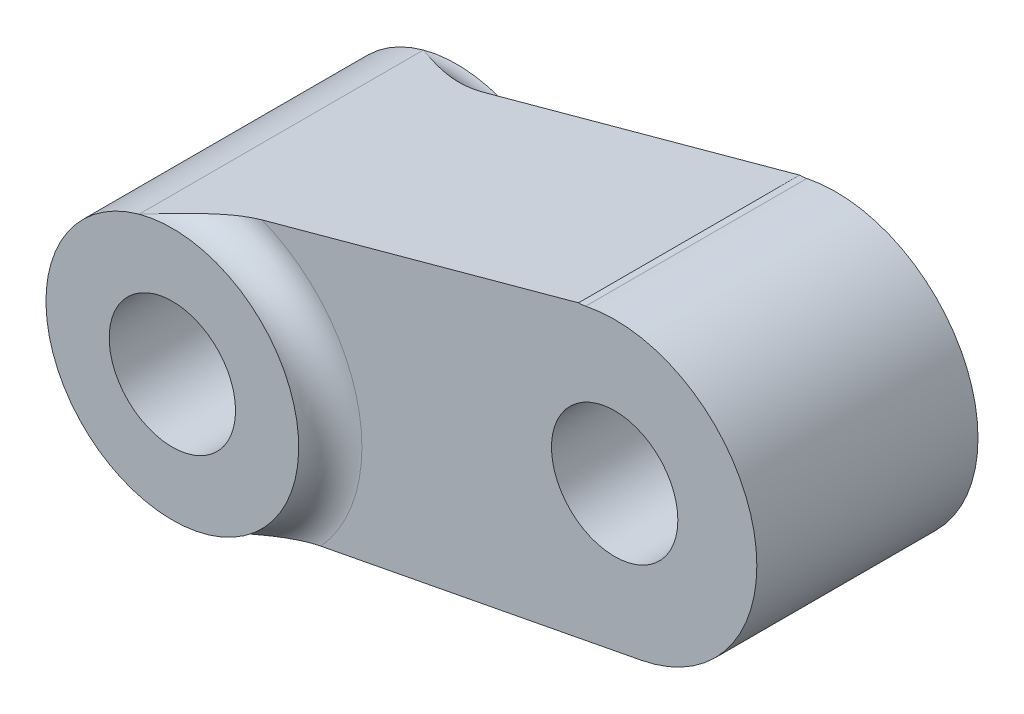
ISO-10303-21;
HEADER;
FILE_DESCRIPTION(('STEP AP214'),'2;1');
FILE_NAME('part.step','',(''),(''),'','','');
FILE_SCHEMA(('AUTOMOTIVE_DESIGN { 1 0 10303 214 1 1 1 1 }'));
ENDSEC;
DATA;
#1=APPLICATION_CONTEXT('core data for automotive mechanical design processes');
#2=APPLICATION_PROTOCOL_DEFINITION('international standard','automotive_design',2000,#1);
#3=PRODUCT_CONTEXT('',#1,'mechanical');
#4=PRODUCT('Part','Part','',(#3));
#5=PRODUCT_RELATED_PRODUCT_CATEGORY('part','',(#4));
#6=PRODUCT_DEFINITION_FORMATION('','',#4);
#7=PRODUCT_DEFINITION_CONTEXT('part definition',#1,'design');
#8=PRODUCT_DEFINITION('design','',#6,#7);
#9=PRODUCT_DEFINITION_SHAPE('','',#8);
#10=(LENGTH_UNIT() NAMED_UNIT(*) SI_UNIT(.MILLI.,.METRE.));
#11=(NAMED_UNIT(*) PLANE_ANGLE_UNIT() SI_UNIT($,.RADIAN.));
#12=(NAMED_UNIT(*) SI_UNIT($,.STERADIAN.) SOLID_ANGLE_UNIT());
#13=UNCERTAINTY_MEASURE_WITH_UNIT(LENGTH_MEASURE(1.E-05),#10,'distance_accuracy_value','');
#14=(GEOMETRIC_REPRESENTATION_CONTEXT(3) GLOBAL_UNCERTAINTY_ASSIGNED_CONTEXT((#13)) GLOBAL_UNIT_ASSIGNED_CONTEXT((#10,
#11,#12)) REPRESENTATION_CONTEXT('',''));
#15=CARTESIAN_POINT('',(0.,0.,0.));
#16=DIRECTION('',(0.,0.,1.));
#17=DIRECTION('',(1.,0.,0.));
#18=AXIS2_PLACEMENT_3D('',#15,#16,#17);
#19=CARTESIAN_POINT('',(-3.,-26.,-7.));
#20=DIRECTION('',(0.,0.,1.));
#21=DIRECTION('',(1.,0.,0.));
#22=AXIS2_PLACEMENT_3D('',#19,#20,#21);
#23=CYLINDRICAL_SURFACE('',#22,8.);
#24=CARTESIAN_POINT('',(-3.,-26.,-9.));
#25=DIRECTION('',(0.,0.,-1.));
#26=DIRECTION('',(-1.,0.,0.));
#27=AXIS2_PLACEMENT_3D('',#24,#25,#26);
#28=CIRCLE('',#27,8.);
#29=CARTESIAN_POINT('',(-1.49452247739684,-33.8570692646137,-9.));
#30=VERTEX_POINT('',#29);
#31=CARTESIAN_POINT('',(-5.10755430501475,-18.2826031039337,-9.));
#32=VERTEX_POINT('',#31);
#33=EDGE_CURVE('E211',#30,#32,#28,.T.);
#34=ORIENTED_EDGE('',*,*,#33,.F.);
#35=DIRECTION('',(0.,0.,1.));
#36=VECTOR('',#35,1.);
#37=CARTESIAN_POINT('',(-1.49452247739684,-33.8570692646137,-7.));
#38=LINE('',#37,#36);
#39=CARTESIAN_POINT('',(-1.49452247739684,-33.8570692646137,9.));
#40=VERTEX_POINT('',#39);
#41=EDGE_CURVE('E123',#30,#40,#38,.T.);
#42=ORIENTED_EDGE('',*,*,#41,.T.);
#43=CARTESIAN_POINT('',(-3.,-26.,9.));
#44=DIRECTION('',(0.,0.,1.));
#45=DIRECTION('',(1.,0.,0.));
#46=AXIS2_PLACEMENT_3D('',#43,#44,#45);
#47=CIRCLE('',#46,8.);
#48=CARTESIAN_POINT('',(-5.10755430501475,-18.2826031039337,8.99999999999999));
#49=VERTEX_POINT('',#48);
#50=EDGE_CURVE('E256',#49,#40,#47,.T.);
#51=ORIENTED_EDGE('',*,*,#50,.F.);
#52=DIRECTION('',(0.,0.,1.));
#53=VECTOR('',#52,1.);
#54=CARTESIAN_POINT('',(-5.10755430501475,-18.2826031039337,-10.5));
#55=LINE('',#54,#53);
#56=EDGE_CURVE('E217',#32,#49,#55,.T.);
#57=ORIENTED_EDGE('',*,*,#56,.F.);
#58=EDGE_LOOP('',(#34,#42,#51,#57));
#59=FACE_BOUND('',#58,.T.);
#60=CARTESIAN_POINT('',(-10.9668807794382,-25.2728063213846,0.));
#61=CARTESIAN_POINT('',(-10.9668813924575,-25.2728074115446,-0.136694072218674));
#62=CARTESIAN_POINT('',(-10.9679843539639,-25.2846058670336,-0.273397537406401));
#63=CARTESIAN_POINT('',(-10.9720352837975,-25.3312792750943,-0.542788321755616));
#64=CARTESIAN_POINT('',(-10.9749837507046,-25.3661604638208,-0.675474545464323));
#65=CARTESIAN_POINT('',(-10.9817128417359,-25.4574748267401,-0.932889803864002));
#66=CARTESIAN_POINT('',(-10.9854919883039,-25.513869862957,-1.05763246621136));
#67=CARTESIAN_POINT('',(-10.9924453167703,-25.6461780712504,-1.29630539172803));
#68=CARTESIAN_POINT('',(-10.9956193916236,-25.722094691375,-1.41023373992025));
#69=CARTESIAN_POINT('',(-10.9997674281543,-25.8937096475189,-1.62795773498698));
#70=CARTESIAN_POINT('',(-11.0006697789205,-25.9899505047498,-1.73132721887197));
#71=CARTESIAN_POINT('',(-10.9982283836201,-26.1978195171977,-1.92119202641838));
#72=CARTESIAN_POINT('',(-10.994884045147,-26.3094498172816,-2.0076849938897));
#73=CARTESIAN_POINT('',(-10.9821436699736,-26.5476332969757,-2.16322212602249));
#74=CARTESIAN_POINT('',(-10.9726124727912,-26.6744668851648,-2.23182740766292));
#75=CARTESIAN_POINT('',(-10.9460169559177,-26.937127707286,-2.3467520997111));
#76=CARTESIAN_POINT('',(-10.928954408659,-27.0729528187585,-2.39307674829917));
#77=CARTESIAN_POINT('',(-10.8872808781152,-27.3450464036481,-2.46070225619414));
#78=CARTESIAN_POINT('',(-10.8629191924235,-27.4811717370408,-2.4827314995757));
#79=CARTESIAN_POINT('',(-10.8066708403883,-27.7536309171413,-2.50344869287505));
#80=CARTESIAN_POINT('',(-10.7747858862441,-27.8899647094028,-2.50214194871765));
#81=CARTESIAN_POINT('',(-10.7057256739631,-28.1540164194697,-2.47670341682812));
#82=CARTESIAN_POINT('',(-10.6687710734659,-28.281869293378,-2.45336123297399));
#83=CARTESIAN_POINT('',(-10.5903685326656,-28.5304750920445,-2.38581001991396));
#84=CARTESIAN_POINT('',(-10.5489202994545,-28.6512275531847,-2.34159962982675));
#85=CARTESIAN_POINT('',(-10.4630593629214,-28.8841558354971,-2.23305962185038));
#86=CARTESIAN_POINT('',(-10.4186165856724,-28.996208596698,-2.16849038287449));
#87=CARTESIAN_POINT('',(-10.3296578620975,-29.2076934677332,-2.02125780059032));
#88=CARTESIAN_POINT('',(-10.2851419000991,-29.3071223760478,-1.93858988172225));
#89=CARTESIAN_POINT('',(-10.196832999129,-29.4952611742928,-1.75345273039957));
#90=CARTESIAN_POINT('',(-10.1531475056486,-29.5833516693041,-1.65030186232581));
#91=CARTESIAN_POINT('',(-10.0715033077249,-29.7418998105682,-1.42920979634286));
#92=CARTESIAN_POINT('',(-10.0335452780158,-29.8123553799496,-1.31126685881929));
#93=CARTESIAN_POINT('',(-9.96584712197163,-29.9347094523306,-1.06216506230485));
#94=CARTESIAN_POINT('',(-9.936203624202,-29.9863916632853,-0.930873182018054));
#95=CARTESIAN_POINT('',(-9.88827574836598,-30.0686545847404,-0.659881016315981));
#96=CARTESIAN_POINT('',(-9.86998728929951,-30.0992428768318,-0.520183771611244));
#97=CARTESIAN_POINT('',(-9.84695679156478,-30.1375918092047,-0.242360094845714));
#98=CARTESIAN_POINT('',(-9.84170007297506,-30.1462201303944,-0.104396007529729));
#99=CARTESIAN_POINT('',(-9.84370967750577,-30.1429028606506,0.171179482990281));
#100=CARTESIAN_POINT('',(-9.8509740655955,-30.1309604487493,0.308790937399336));
#101=CARTESIAN_POINT('',(-9.87697097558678,-30.0875264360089,0.575616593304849));
#102=CARTESIAN_POINT('',(-9.89536580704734,-30.056610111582,0.704958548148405));
#103=CARTESIAN_POINT('',(-9.94182613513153,-29.9765784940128,0.956043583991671));
#104=CARTESIAN_POINT('',(-9.96989320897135,-29.9274602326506,1.07778542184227));
#105=CARTESIAN_POINT('',(-10.0345265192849,-29.8105130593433,1.31407821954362));
#106=CARTESIAN_POINT('',(-10.0713134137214,-29.7421879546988,1.42832283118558));
#107=CARTESIAN_POINT('',(-10.1503113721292,-29.5889366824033,1.6429806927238));
#108=CARTESIAN_POINT('',(-10.192523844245,-29.5040062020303,1.74339033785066));
#109=CARTESIAN_POINT('',(-10.2814643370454,-29.3153546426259,1.93182073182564));
#110=CARTESIAN_POINT('',(-10.3283069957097,-29.2110006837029,2.01915557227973));
#111=CARTESIAN_POINT('',(-10.4218962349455,-28.9883141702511,2.17378208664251));
#112=CARTESIAN_POINT('',(-10.4686428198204,-28.8699822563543,2.24107467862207));
#113=CARTESIAN_POINT('',(-10.5588777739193,-28.6230702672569,2.35306112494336));
#114=CARTESIAN_POINT('',(-10.6023877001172,-28.4945725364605,2.39791857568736));
#115=CARTESIAN_POINT('',(-10.6841328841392,-28.230074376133,2.46414507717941));
#116=CARTESIAN_POINT('',(-10.7223697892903,-28.0940763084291,2.48552147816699));
#117=CARTESIAN_POINT('',(-10.7903774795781,-27.8244318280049,2.50358200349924));
#118=CARTESIAN_POINT('',(-10.8204344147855,-27.6909231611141,2.50125690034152));
#119=CARTESIAN_POINT('',(-10.8732827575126,-27.424721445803,2.47437637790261));
#120=CARTESIAN_POINT('',(-10.8960746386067,-27.292028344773,2.4498224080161));
#121=CARTESIAN_POINT('',(-10.9340941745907,-27.0330001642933,2.37981198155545));
#122=CARTESIAN_POINT('',(-10.9494128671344,-26.9066063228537,2.33462078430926));
#123=CARTESIAN_POINT('',(-10.9735223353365,-26.6618752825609,2.22485834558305));
#124=CARTESIAN_POINT('',(-10.9823119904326,-26.5435394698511,2.16028378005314));
#125=CARTESIAN_POINT('',(-10.9946806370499,-26.3142029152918,2.01105448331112));
#126=CARTESIAN_POINT('',(-10.9980727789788,-26.2035871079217,1.92579295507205));
#127=CARTESIAN_POINT('',(-11.0006658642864,-25.9973154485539,1.73868022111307));
#128=CARTESIAN_POINT('',(-10.9998655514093,-25.9016640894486,1.63682405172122));
#129=CARTESIAN_POINT('',(-10.9957839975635,-25.7252343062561,1.4153685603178));
#130=CARTESIAN_POINT('',(-10.9924214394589,-25.6450536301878,1.29529319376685));
#131=CARTESIAN_POINT('',(-10.9850654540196,-25.5064697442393,1.04320375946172));
#132=CARTESIAN_POINT('',(-10.981072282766,-25.4480577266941,0.911194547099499));
#133=CARTESIAN_POINT('',(-10.9744157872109,-25.3592918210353,0.65055476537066));
#134=CARTESIAN_POINT('',(-10.9716681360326,-25.3269711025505,0.522594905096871));
#135=CARTESIAN_POINT('',(-10.9679005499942,-25.2837304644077,0.263092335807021));
#136=CARTESIAN_POINT('',(-10.9668801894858,-25.2728052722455,0.131550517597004));
#137=CARTESIAN_POINT('',(-10.9668807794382,-25.2728063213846,0.));
#138=B_SPLINE_CURVE_WITH_KNOTS('',3,(#60,#61,#62,#63,#64,#65,#66,#67,#68,#69,#70,#71,#72,#73,
#74,#75,#76,#77,#78,#79,#80,#81,#82,#83,#84,#85,#86,#87,#88,#89,#90,#91,#92,#93,#94,#95,#96,#97,
#98,#99,#100,#101,#102,#103,#104,#105,#106,#107,#108,#109,#110,#111,#112,#113,#114,#115,#116,
#117,#118,#119,#120,#121,#122,#123,#124,#125,#126,#127,#128,#129,#130,#131,#132,#133,#134,#135,
#136,#137),.UNSPECIFIED.,.T.,.F.,(4,2,2,2,2,2,2,2,2,2,2,2,2,2,2,2,2,2,2,2,2,2,2,2,2,2,2,2,2,2,2,
2,2,2,2,2,2,2,4),(0.,0.409596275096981,0.819303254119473,1.22828728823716,1.6373436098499,
2.05914161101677,2.48099845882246,2.91239643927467,3.34369294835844,3.76167445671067,
4.17956092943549,4.58301965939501,4.98650470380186,5.39492809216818,5.80345485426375,
6.22900677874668,6.65460879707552,7.08496941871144,7.5151752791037,7.92809866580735,
8.34095824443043,8.7418794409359,9.14286604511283,9.55535226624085,9.96794576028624,
10.3976387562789,10.8273120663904,11.2538047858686,11.6801639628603,12.0887760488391,
12.4973614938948,12.9008369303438,13.3043815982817,13.7216138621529,14.1389711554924,
14.5701559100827,15.0011660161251,15.3954470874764,15.7896309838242),.UNSPECIFIED.);
#139=CARTESIAN_POINT('',(-10.9668807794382,-25.2728063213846,0.));
#140=VERTEX_POINT('',#139);
#141=EDGE_CURVE('E215',#140,#140,#138,.T.);
#142=ORIENTED_EDGE('',*,*,#141,.F.);
#143=EDGE_LOOP('',(#142));
#144=FACE_BOUND('',#143,.T.);
#145=ADVANCED_FACE('F37',(#59,#144),#23,.T.);
#146=CARTESIAN_POINT('',(-3.,-26.,-7.));
#147=DIRECTION('',(0.,0.,1.));
#148=DIRECTION('',(1.,0.,0.));
#149=AXIS2_PLACEMENT_3D('',#146,#147,#148);
#150=CYLINDRICAL_SURFACE('',#149,4.);
#151=CARTESIAN_POINT('',(-3.,-26.,-9.));
#152=DIRECTION('',(0.,0.,-1.));
#153=DIRECTION('',(-1.,0.,0.));
#154=AXIS2_PLACEMENT_3D('',#151,#152,#153);
#155=CIRCLE('',#154,4.);
#156=CARTESIAN_POINT('',(-7.,-26.,-9.));
#157=VERTEX_POINT('',#156);
#158=EDGE_CURVE('E162',#157,#157,#155,.T.);
#159=ORIENTED_EDGE('',*,*,#158,.T.);
#160=EDGE_LOOP('',(#159));
#161=FACE_BOUND('',#160,.T.);
#162=CARTESIAN_POINT('',(-3.,-26.,9.));
#163=DIRECTION('',(0.,0.,1.));
#164=DIRECTION('',(1.,0.,0.));
#165=AXIS2_PLACEMENT_3D('',#162,#163,#164);
#166=CIRCLE('',#165,4.);
#167=CARTESIAN_POINT('',(1.,-26.,9.));
#168=VERTEX_POINT('',#167);
#169=EDGE_CURVE('E288',#168,#168,#166,.T.);
#170=ORIENTED_EDGE('',*,*,#169,.T.);
#171=EDGE_LOOP('',(#170));
#172=FACE_BOUND('',#171,.T.);
#173=CARTESIAN_POINT('',(-6.60468430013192,-24.2661455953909,0.));
#174=CARTESIAN_POINT('',(-6.60468506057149,-24.2661463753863,-0.0621567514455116));
#175=CARTESIAN_POINT('',(-6.60597981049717,-24.2688298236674,-0.124325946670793));
#176=CARTESIAN_POINT('',(-6.61107731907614,-24.2794913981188,-0.248117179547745));
#177=CARTESIAN_POINT('',(-6.61488155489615,-24.2874726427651,-0.309738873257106));
#178=CARTESIAN_POINT('',(-6.62979397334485,-24.3191737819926,-0.493226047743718));
#179=CARTESIAN_POINT('',(-6.6444010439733,-24.3506504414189,-0.613548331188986));
#180=CARTESIAN_POINT('',(-6.67992002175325,-24.4315363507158,-0.845598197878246));
#181=CARTESIAN_POINT('',(-6.70077700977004,-24.4807901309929,-0.957390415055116));
#182=CARTESIAN_POINT('',(-6.74555208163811,-24.5947982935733,-1.17200852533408));
#183=CARTESIAN_POINT('',(-6.76947024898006,-24.6595530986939,-1.27483417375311));
#184=CARTESIAN_POINT('',(-6.82052264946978,-24.8121855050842,-1.48373398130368));
#185=CARTESIAN_POINT('',(-6.84765786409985,-24.9019997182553,-1.58839332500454));
#186=CARTESIAN_POINT('',(-6.89798386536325,-25.0967421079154,-1.78376155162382));
#187=CARTESIAN_POINT('',(-6.92117121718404,-25.2016833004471,-1.87445827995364));
#188=CARTESIAN_POINT('',(-6.96238113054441,-25.4382535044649,-2.0502202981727));
#189=CARTESIAN_POINT('',(-6.97944313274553,-25.5715748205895,-2.13328618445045));
#190=CARTESIAN_POINT('',(-6.99461748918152,-25.780985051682,-2.24054515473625));
#191=CARTESIAN_POINT('',(-6.99793862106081,-25.8523817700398,-2.27341513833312));
#192=CARTESIAN_POINT('',(-7.00065785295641,-25.9977700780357,-2.33295468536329));
#193=CARTESIAN_POINT('',(-7.00005867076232,-26.0717598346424,-2.35962853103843));
#194=CARTESIAN_POINT('',(-6.99483747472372,-26.2140586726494,-2.40398381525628));
#195=CARTESIAN_POINT('',(-6.99062855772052,-26.28218521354,-2.42230197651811));
#196=CARTESIAN_POINT('',(-6.97855199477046,-26.4193568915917,-2.45330228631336));
#197=CARTESIAN_POINT('',(-6.97068646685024,-26.4884014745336,-2.46598768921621));
#198=CARTESIAN_POINT('',(-6.95120932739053,-26.6267518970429,-2.48551379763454));
#199=CARTESIAN_POINT('',(-6.93960003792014,-26.696057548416,-2.49235811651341));
#200=CARTESIAN_POINT('',(-6.91267013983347,-26.8342538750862,-2.50009921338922));
#201=CARTESIAN_POINT('',(-6.89734995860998,-26.9031445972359,-2.50099667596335));
#202=CARTESIAN_POINT('',(-6.8506026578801,-27.0897981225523,-2.49527462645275));
#203=CARTESIAN_POINT('',(-6.81557874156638,-27.2065492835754,-2.48269349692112));
#204=CARTESIAN_POINT('',(-6.73625866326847,-27.4334794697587,-2.44026978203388));
#205=CARTESIAN_POINT('',(-6.69196180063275,-27.5436579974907,-2.41042589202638));
#206=CARTESIAN_POINT('',(-6.59614707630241,-27.7553523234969,-2.33479144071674));
#207=CARTESIAN_POINT('',(-6.54461094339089,-27.8568451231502,-2.28896008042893));
#208=CARTESIAN_POINT('',(-6.43691366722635,-28.0493440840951,-2.18306276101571));
#209=CARTESIAN_POINT('',(-6.38075147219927,-28.1403478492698,-2.12299355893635));
#210=CARTESIAN_POINT('',(-6.25926043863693,-28.3217596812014,-1.98194358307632));
#211=CARTESIAN_POINT('',(-6.19366062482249,-28.4106842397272,-1.89929072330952));
#212=CARTESIAN_POINT('',(-6.06357800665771,-28.5739887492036,-1.71973526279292));
#213=CARTESIAN_POINT('',(-5.99909698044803,-28.648347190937,-1.62281195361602));
#214=CARTESIAN_POINT('',(-5.86729211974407,-28.7909188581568,-1.40258874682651));
#215=CARTESIAN_POINT('',(-5.80069668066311,-28.857061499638,-1.27749723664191));
#216=CARTESIAN_POINT('',(-5.68123277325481,-28.969468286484,-1.01270776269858));
#217=CARTESIAN_POINT('',(-5.62833908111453,-29.0157690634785,-0.87303731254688));
#218=CARTESIAN_POINT('',(-5.55521153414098,-29.0777525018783,-0.620461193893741));
#219=CARTESIAN_POINT('',(-5.53004666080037,-29.0982852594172,-0.510178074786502));
#220=CARTESIAN_POINT('',(-5.49428900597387,-29.1271505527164,-0.285769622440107));
#221=CARTESIAN_POINT('',(-5.48367631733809,-29.1354997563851,-0.171649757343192));
#222=CARTESIAN_POINT('',(-5.47840767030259,-29.1396673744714,0.057457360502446));
#223=CARTESIAN_POINT('',(-5.48378827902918,-29.1354570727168,0.17244600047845));
#224=CARTESIAN_POINT('',(-5.50983887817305,-29.1146379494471,0.399561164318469));
#225=CARTESIAN_POINT('',(-5.53052153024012,-29.0980188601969,0.51168523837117));
#226=CARTESIAN_POINT('',(-5.58419934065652,-29.0533737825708,0.728436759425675));
#227=CARTESIAN_POINT('',(-5.61698591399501,-29.0255403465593,0.833157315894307));
#228=CARTESIAN_POINT('',(-5.69186079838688,-28.959118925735,1.03557469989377));
#229=CARTESIAN_POINT('',(-5.73395240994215,-28.9205271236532,1.13326901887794));
#230=CARTESIAN_POINT('',(-5.83313595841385,-28.8247028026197,1.33861194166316));
#231=CARTESIAN_POINT('',(-5.89155805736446,-28.7653201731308,1.44461452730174));
#232=CARTESIAN_POINT('',(-6.01313961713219,-28.632322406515,1.64437066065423));
#233=CARTESIAN_POINT('',(-6.07630395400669,-28.5586924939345,1.73811132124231));
#234=CARTESIAN_POINT('',(-6.21378945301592,-28.3844842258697,1.92596407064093));
#235=CARTESIAN_POINT('',(-6.2882761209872,-28.2814780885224,2.01772739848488));
#236=CARTESIAN_POINT('',(-6.43302474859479,-28.0571985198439,2.1801470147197));
#237=CARTESIAN_POINT('',(-6.50328867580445,-27.9359336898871,2.2508131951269));
#238=CARTESIAN_POINT('',(-6.59945903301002,-27.7460167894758,2.33658106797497));
#239=CARTESIAN_POINT('',(-6.62916217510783,-27.6834817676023,2.36129744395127));
#240=CARTESIAN_POINT('',(-6.6859181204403,-27.5552834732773,2.40493827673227));
#241=CARTESIAN_POINT('',(-6.71297245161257,-27.4896220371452,2.42386608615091));
#242=CARTESIAN_POINT('',(-6.7639299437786,-27.3557128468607,2.45560583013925));
#243=CARTESIAN_POINT('',(-6.78783584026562,-27.2874674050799,2.46842309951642));
#244=CARTESIAN_POINT('',(-6.83211541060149,-27.1489937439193,2.48773917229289));
#245=CARTESIAN_POINT('',(-6.85248966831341,-27.0787658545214,2.49423902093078));
#246=CARTESIAN_POINT('',(-6.90237892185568,-26.8870941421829,2.50307151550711));
#247=CARTESIAN_POINT('',(-6.92825578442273,-26.7643404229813,2.49926579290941));
#248=CARTESIAN_POINT('',(-6.96814114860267,-26.5189816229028,2.47308241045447));
#249=CARTESIAN_POINT('',(-6.98215018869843,-26.3963765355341,2.4507055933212));
#250=CARTESIAN_POINT('',(-6.99854264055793,-26.159104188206,2.38967758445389));
#251=CARTESIAN_POINT('',(-7.0013125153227,-26.044309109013,2.35161792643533));
#252=CARTESIAN_POINT('',(-6.99755135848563,-25.8208697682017,2.26088053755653));
#253=CARTESIAN_POINT('',(-6.99101875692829,-25.7122265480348,2.2082003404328));
#254=CARTESIAN_POINT('',(-6.96933443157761,-25.4922261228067,2.08367872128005));
#255=CARTESIAN_POINT('',(-6.95335846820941,-25.3817576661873,2.01041600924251));
#256=CARTESIAN_POINT('',(-6.9149574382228,-25.1726957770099,1.84984676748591));
#257=CARTESIAN_POINT('',(-6.89252507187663,-25.0741159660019,1.76252439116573));
#258=CARTESIAN_POINT('',(-6.84078394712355,-24.8774422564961,1.56176748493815));
#259=CARTESIAN_POINT('',(-6.81095008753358,-24.7814665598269,1.44638338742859));
#260=CARTESIAN_POINT('',(-6.75201274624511,-24.6105470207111,1.20071059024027));
#261=CARTESIAN_POINT('',(-6.72290886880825,-24.5355915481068,1.0704301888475));
#262=CARTESIAN_POINT('',(-6.67702910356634,-24.4244856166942,0.827194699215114));
#263=CARTESIAN_POINT('',(-6.65894963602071,-24.3834265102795,0.716729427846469));
#264=CARTESIAN_POINT('',(-6.62975374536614,-24.318876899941,0.490060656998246));
#265=CARTESIAN_POINT('',(-6.61861530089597,-24.2953307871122,0.3738765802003));
#266=CARTESIAN_POINT('',(-6.60955475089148,-24.2763023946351,0.213940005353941));
#267=CARTESIAN_POINT('',(-6.60773454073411,-24.2724998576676,0.171274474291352));
#268=CARTESIAN_POINT('',(-6.60529890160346,-24.2674208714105,0.0857413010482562));
#269=CARTESIAN_POINT('',(-6.60468377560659,-24.2661450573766,0.0428736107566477));
#270=CARTESIAN_POINT('',(-6.60468430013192,-24.2661455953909,0.));
#271=B_SPLINE_CURVE_WITH_KNOTS('',3,(#173,#174,#175,#176,#177,#178,#179,#180,#181,#182,#183,
#184,#185,#186,#187,#188,#189,#190,#191,#192,#193,#194,#195,#196,#197,#198,#199,#200,#201,#202,
#203,#204,#205,#206,#207,#208,#209,#210,#211,#212,#213,#214,#215,#216,#217,#218,#219,#220,#221,
#222,#223,#224,#225,#226,#227,#228,#229,#230,#231,#232,#233,#234,#235,#236,#237,#238,#239,#240,
#241,#242,#243,#244,#245,#246,#247,#248,#249,#250,#251,#252,#253,#254,#255,#256,#257,#258,#259,
#260,#261,#262,#263,#264,#265,#266,#267,#268,#269,#270),.UNSPECIFIED.,.T.,.F.,(4,2,2,2,2,2,2,2,
2,2,2,2,2,2,2,2,2,2,2,2,2,2,2,2,2,2,2,2,2,2,2,2,2,2,2,2,2,2,2,2,2,2,2,2,2,2,2,2,4),(0.,
0.186415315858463,0.3729404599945,0.746478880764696,1.11682668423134,1.48718459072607,
1.90722798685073,2.32763499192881,2.79876029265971,3.03445880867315,3.2699939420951,
3.48170145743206,3.69328649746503,3.90474055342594,4.11617026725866,4.48184709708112,
4.84755156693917,5.21419620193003,5.58092442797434,5.99329080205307,6.40626158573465,
6.87316206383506,7.33919680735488,7.68265621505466,8.02564530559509,8.36941921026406,
8.71347788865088,9.05186495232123,9.39037223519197,9.79332737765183,10.1967026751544,
10.6647326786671,11.1325428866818,11.3527929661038,11.5729152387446,11.7928449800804,
12.0127383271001,12.3871595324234,12.7615637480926,13.1229788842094,13.4844550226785,
13.8834503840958,14.2828986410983,14.7399238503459,15.1966956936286,15.5530255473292,
15.9082190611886,16.0367696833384,16.1653526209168),.UNSPECIFIED.);
#272=CARTESIAN_POINT('',(-6.60468430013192,-24.2661455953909,0.));
#273=VERTEX_POINT('',#272);
#274=EDGE_CURVE('E218',#273,#273,#271,.T.);
#275=ORIENTED_EDGE('',*,*,#274,.T.);
#276=EDGE_LOOP('',(#275));
#277=FACE_BOUND('',#276,.T.);
#278=ADVANCED_FACE('F194',(#161,#172,#277),#150,.F.);
#279=CARTESIAN_POINT('',(-3.,-26.,-7.));
#280=DIRECTION('',(0.,0.,1.));
#281=DIRECTION('',(1.,0.,0.));
#282=AXIS2_PLACEMENT_3D('',#279,#280,#281);
#283=PLANE('',#282);
#284=CARTESIAN_POINT('',(23.,-20.,-7.));
#285=DIRECTION('',(0.,0.,1.));
#286=DIRECTION('',(1.,0.,0.));
#287=AXIS2_PLACEMENT_3D('',#284,#285,#286);
#288=CIRCLE('',#287,4.);
#289=CARTESIAN_POINT('',(27.,-20.,-7.));
#290=VERTEX_POINT('',#289);
#291=EDGE_CURVE('E250',#290,#290,#288,.T.);
#292=ORIENTED_EDGE('',*,*,#291,.T.);
#293=EDGE_LOOP('',(#292));
#294=FACE_BOUND('',#293,.T.);
#295=CARTESIAN_POINT('',(-3.,-26.,-7.));
#296=DIRECTION('',(0.,0.,1.));
#297=DIRECTION('',(1.,0.,0.));
#298=AXIS2_PLACEMENT_3D('',#295,#296,#297);
#299=CIRCLE('',#298,10.);
#300=CARTESIAN_POINT('',(4.3982794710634,-32.7279611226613,-7.));
#301=VERTEX_POINT('',#300);
#302=CARTESIAN_POINT('',(0.680493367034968,-16.7019373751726,-7.));
#303=VERTEX_POINT('',#302);
#304=EDGE_CURVE('E118',#301,#303,#299,.T.);
#305=ORIENTED_EDGE('',*,*,#304,.T.);
#306=DIRECTION('',(0.964674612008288,0.263444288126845,0.));
#307=VECTOR('',#306,1.);
#308=CARTESIAN_POINT('',(-5.10755430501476,-18.2826031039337,-7.));
#309=LINE('',#308,#307);
#310=CARTESIAN_POINT('',(20.7127394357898,-11.2313043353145,-7.));
#311=VERTEX_POINT('',#310);
#312=EDGE_CURVE('E279',#303,#311,#309,.T.);
#313=ORIENTED_EDGE('',*,*,#312,.T.);
#314=CARTESIAN_POINT('',(20.7540314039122,-9.23173063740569,-7.));
#315=DIRECTION('',(0.,0.,1.));
#316=DIRECTION('',(1.,0.,0.));
#317=AXIS2_PLACEMENT_3D('',#314,#315,#316);
#318=CIRCLE('',#317,2.);
#319=CARTESIAN_POINT('',(21.1623893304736,-11.189597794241,-7.));
#320=VERTEX_POINT('',#319);
#321=EDGE_CURVE('E45',#311,#320,#318,.T.);
#322=ORIENTED_EDGE('',*,*,#321,.T.);
#323=CARTESIAN_POINT('',(23.,-20.,-7.));
#324=DIRECTION('',(0.,0.,1.));
#325=DIRECTION('',(1.,0.,0.));
#326=AXIS2_PLACEMENT_3D('',#323,#324,#325);
#327=CIRCLE('',#326,9.);
#328=CARTESIAN_POINT('',(24.6936622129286,-28.8392029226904,-7.));
#329=VERTEX_POINT('',#328);
#330=EDGE_CURVE('E126',#329,#320,#327,.T.);
#331=ORIENTED_EDGE('',*,*,#330,.F.);
#332=DIRECTION('',(0.982133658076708,0.188184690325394,0.));
#333=VECTOR('',#332,1.);
#334=CARTESIAN_POINT('',(-1.49452247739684,-33.8570692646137,-7.));
#335=LINE('',#334,#333);
#336=EDGE_CURVE('E117',#301,#329,#335,.T.);
#337=ORIENTED_EDGE('',*,*,#336,.F.);
#338=EDGE_LOOP('',(#305,#313,#322,#331,#337));
#339=FACE_BOUND('',#338,.T.);
#340=ADVANCED_FACE('F189',(#294,#339),#283,.F.);
#341=CARTESIAN_POINT('',(-3.,-26.,7.));
#342=DIRECTION('',(0.,0.,1.));
#343=DIRECTION('',(1.,0.,0.));
#344=AXIS2_PLACEMENT_3D('',#341,#342,#343);
#345=PLANE('',#344);
#346=DIRECTION('',(0.964674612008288,0.263444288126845,0.));
#347=VECTOR('',#346,1.);
#348=CARTESIAN_POINT('',(-5.10755430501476,-18.2826031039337,7.));
#349=LINE('',#348,#347);
#350=CARTESIAN_POINT('',(0.680493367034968,-16.7019373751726,7.));
#351=VERTEX_POINT('',#350);
#352=CARTESIAN_POINT('',(20.7127394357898,-11.2313043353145,7.));
#353=VERTEX_POINT('',#352);
#354=EDGE_CURVE('E59',#351,#353,#349,.T.);
#355=ORIENTED_EDGE('',*,*,#354,.F.);
#356=CARTESIAN_POINT('',(-3.,-26.,7.));
#357=DIRECTION('',(0.,0.,1.));
#358=DIRECTION('',(1.,0.,0.));
#359=AXIS2_PLACEMENT_3D('',#356,#357,#358);
#360=CIRCLE('',#359,10.);
#361=CARTESIAN_POINT('',(4.3982794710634,-32.7279611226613,7.));
#362=VERTEX_POINT('',#361);
#363=EDGE_CURVE('E121',#351,#362,#360,.F.);
#364=ORIENTED_EDGE('',*,*,#363,.T.);
#365=DIRECTION('',(0.982133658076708,0.188184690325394,0.));
#366=VECTOR('',#365,1.);
#367=CARTESIAN_POINT('',(-1.49452247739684,-33.8570692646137,7.));
#368=LINE('',#367,#366);
#369=CARTESIAN_POINT('',(24.6936622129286,-28.8392029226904,7.));
#370=VERTEX_POINT('',#369);
#371=EDGE_CURVE('E255',#362,#370,#368,.T.);
#372=ORIENTED_EDGE('',*,*,#371,.T.);
#373=CARTESIAN_POINT('',(23.,-20.,7.));
#374=DIRECTION('',(0.,0.,1.));
#375=DIRECTION('',(1.,0.,0.));
#376=AXIS2_PLACEMENT_3D('',#373,#374,#375);
#377=CIRCLE('',#376,9.);
#378=CARTESIAN_POINT('',(21.1623893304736,-11.189597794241,7.));
#379=VERTEX_POINT('',#378);
#380=EDGE_CURVE('E259',#370,#379,#377,.T.);
#381=ORIENTED_EDGE('',*,*,#380,.T.);
#382=CARTESIAN_POINT('',(20.7540314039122,-9.23173063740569,7.));
#383=DIRECTION('',(0.,0.,1.));
#384=DIRECTION('',(1.,0.,0.));
#385=AXIS2_PLACEMENT_3D('',#382,#383,#384);
#386=CIRCLE('',#385,2.);
#387=EDGE_CURVE('E275',#379,#353,#386,.F.);
#388=ORIENTED_EDGE('',*,*,#387,.T.);
#389=EDGE_LOOP('',(#355,#364,#372,#381,#388));
#390=FACE_BOUND('',#389,.T.);
#391=CARTESIAN_POINT('',(23.,-20.,7.));
#392=DIRECTION('',(0.,0.,1.));
#393=DIRECTION('',(1.,0.,0.));
#394=AXIS2_PLACEMENT_3D('',#391,#392,#393);
#395=CIRCLE('',#394,4.);
#396=CARTESIAN_POINT('',(27.,-20.,7.));
#397=VERTEX_POINT('',#396);
#398=EDGE_CURVE('E253',#397,#397,#395,.T.);
#399=ORIENTED_EDGE('',*,*,#398,.F.);
#400=EDGE_LOOP('',(#399));
#401=FACE_BOUND('',#400,.T.);
#402=ADVANCED_FACE('F186',(#390,#401),#345,.T.);
#403=CARTESIAN_POINT('',(23.,-20.,-7.));
#404=DIRECTION('',(0.,0.,1.));
#405=DIRECTION('',(1.,0.,0.));
#406=AXIS2_PLACEMENT_3D('',#403,#404,#405);
#407=CYLINDRICAL_SURFACE('',#406,9.);
#408=CARTESIAN_POINT('',(24.6936622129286,-28.8392029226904,2.5));
#409=CARTESIAN_POINT('',(24.7613428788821,-28.8262423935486,2.50000818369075));
#410=CARTESIAN_POINT('',(24.8288670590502,-28.8124909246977,2.49715094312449));
#411=CARTESIAN_POINT('',(24.9631141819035,-28.7835563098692,2.48576912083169));
#412=CARTESIAN_POINT('',(25.0298372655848,-28.7683734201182,2.4772455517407));
#413=CARTESIAN_POINT('',(25.1618760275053,-28.7367555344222,2.45461894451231));
#414=CARTESIAN_POINT('',(25.2271944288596,-28.7203233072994,2.44052796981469));
#415=CARTESIAN_POINT('',(25.3561078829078,-28.6863805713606,2.40690029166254));
#416=CARTESIAN_POINT('',(25.4197029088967,-28.6688700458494,2.387363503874));
#417=CARTESIAN_POINT('',(25.6072483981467,-28.6150505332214,2.32080662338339));
#418=CARTESIAN_POINT('',(25.728098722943,-28.5774197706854,2.26581586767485));
#419=CARTESIAN_POINT('',(25.9582871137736,-28.5007831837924,2.13630512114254));
#420=CARTESIAN_POINT('',(26.0676214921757,-28.4617769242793,2.06177890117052));
#421=CARTESIAN_POINT('',(26.2747021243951,-28.3838437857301,1.89334530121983));
#422=CARTESIAN_POINT('',(26.3721352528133,-28.3449381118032,1.7990424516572));
#423=CARTESIAN_POINT('',(26.5503235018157,-28.2707040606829,1.59457426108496));
#424=CARTESIAN_POINT('',(26.6310751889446,-28.2353764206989,1.48440566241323));
#425=CARTESIAN_POINT('',(26.77538464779,-28.1702432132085,1.24878266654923));
#426=CARTESIAN_POINT('',(26.8385899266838,-28.1405541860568,1.12307944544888));
#427=CARTESIAN_POINT('',(26.9440585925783,-28.0899843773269,0.861529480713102));
#428=CARTESIAN_POINT('',(26.9863272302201,-28.069101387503,0.725685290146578));
#429=CARTESIAN_POINT('',(27.0479192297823,-28.0383777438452,0.45119593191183));
#430=CARTESIAN_POINT('',(27.0677760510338,-28.0282806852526,0.312699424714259));
#431=CARTESIAN_POINT('',(27.0857473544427,-28.0191507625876,0.0339513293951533));
#432=CARTESIAN_POINT('',(27.0838657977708,-28.0201158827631,-0.106299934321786));
#433=CARTESIAN_POINT('',(27.058822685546,-28.0328161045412,-0.380045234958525));
#434=CARTESIAN_POINT('',(27.0363113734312,-28.0442221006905,-0.513614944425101));
#435=CARTESIAN_POINT('',(26.9715818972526,-28.0763748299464,-0.774708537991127));
#436=CARTESIAN_POINT('',(26.929362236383,-28.097122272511,-0.902231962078));
#437=CARTESIAN_POINT('',(26.8257060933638,-28.1466123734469,-1.14940557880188));
#438=CARTESIAN_POINT('',(26.7640433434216,-28.1754487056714,-1.2689418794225));
#439=CARTESIAN_POINT('',(26.6231462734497,-28.2388569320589,-1.495485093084));
#440=CARTESIAN_POINT('',(26.5439085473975,-28.2734299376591,-1.60248957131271));
#441=CARTESIAN_POINT('',(26.3664897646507,-28.3472320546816,-1.80491706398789));
#442=CARTESIAN_POINT('',(26.2677370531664,-28.3865827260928,-1.8997954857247));
#443=CARTESIAN_POINT('',(26.055441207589,-28.4662335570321,-2.07083572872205));
#444=CARTESIAN_POINT('',(25.9418943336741,-28.5065339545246,-2.14699280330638));
#445=CARTESIAN_POINT('',(25.7020762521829,-28.585733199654,-2.27870390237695));
#446=CARTESIAN_POINT('',(25.5757378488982,-28.6246230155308,-2.33414109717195));
#447=CARTESIAN_POINT('',(25.3142785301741,-28.6984177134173,-2.42190972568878));
#448=CARTESIAN_POINT('',(25.1791707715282,-28.7333283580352,-2.45427493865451));
#449=CARTESIAN_POINT('',(24.9843407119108,-28.77871906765,-2.48302920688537));
#450=CARTESIAN_POINT('',(24.9265013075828,-28.7915940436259,-2.48939365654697));
#451=CARTESIAN_POINT('',(24.8103751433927,-28.8162381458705,-2.49787465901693));
#452=CARTESIAN_POINT('',(24.752089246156,-28.8280090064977,-2.4999979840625));
#453=CARTESIAN_POINT('',(24.6936622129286,-28.8392029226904,-2.50000000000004));
#454=B_SPLINE_CURVE_WITH_KNOTS('',3,(#408,#409,#410,#411,#412,#413,#414,#415,#416,#417,#418,
#419,#420,#421,#422,#423,#424,#425,#426,#427,#428,#429,#430,#431,#432,#433,#434,#435,#436,#437,
#438,#439,#440,#441,#442,#443,#444,#445,#446,#447,#448,#449,#450,#451,#452,#453),.UNSPECIFIED.,
.F.,.F.,(4,2,2,2,2,2,2,2,2,2,2,2,2,2,2,2,2,2,2,2,2,2,4),(0.,0.206659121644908,0.413281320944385,
0.619458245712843,0.825638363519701,1.23756754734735,1.64962824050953,2.07088637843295,
2.49223113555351,2.92151188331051,3.35068491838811,3.76941161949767,4.18806202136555,
4.59395428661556,4.99987738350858,5.41071049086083,5.82162328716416,6.24709344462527,
6.67267136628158,7.10061396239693,7.52792872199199,7.70658286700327,7.88495150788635),.UNSPECIFIED.);
#455=CARTESIAN_POINT('',(24.6936622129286,-28.8392029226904,2.5));
#456=VERTEX_POINT('',#455);
#457=CARTESIAN_POINT('',(24.6936622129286,-28.8392029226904,-2.5));
#458=VERTEX_POINT('',#457);
#459=EDGE_CURVE('E51',#456,#458,#454,.T.);
#460=ORIENTED_EDGE('',*,*,#459,.T.);
#461=DIRECTION('',(0.,0.,1.));
#462=VECTOR('',#461,1.);
#463=CARTESIAN_POINT('',(24.6936622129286,-28.8392029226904,-7.));
#464=LINE('',#463,#462);
#465=EDGE_CURVE('E109',#329,#458,#464,.T.);
#466=ORIENTED_EDGE('',*,*,#465,.F.);
#467=ORIENTED_EDGE('',*,*,#330,.T.);
#468=DIRECTION('',(0.,0.,1.));
#469=VECTOR('',#468,1.);
#470=CARTESIAN_POINT('',(21.1623893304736,-11.189597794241,-7.));
#471=LINE('',#470,#469);
#472=EDGE_CURVE('E270',#320,#379,#471,.T.);
#473=ORIENTED_EDGE('',*,*,#472,.T.);
#474=ORIENTED_EDGE('',*,*,#380,.F.);
#475=EDGE_CURVE('E112',#456,#370,#464,.T.);
#476=ORIENTED_EDGE('',*,*,#475,.F.);
#477=EDGE_LOOP('',(#460,#466,#467,#473,#474,#476));
#478=FACE_BOUND('',#477,.T.);
#479=ADVANCED_FACE('F107',(#478),#407,.T.);
#480=CARTESIAN_POINT('',(-1.49452247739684,-33.8570692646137,-7.));
#481=DIRECTION('',(0.188184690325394,-0.982133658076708,0.));
#482=DIRECTION('',(0.982133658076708,0.188184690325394,0.));
#483=AXIS2_PLACEMENT_3D('',#480,#481,#482);
#484=PLANE('',#483);
#485=CARTESIAN_POINT('',(24.6936622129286,-28.8392029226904,0.));
#486=DIRECTION('',(0.188184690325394,-0.982133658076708,0.));
#487=DIRECTION('',(0.982133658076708,0.188184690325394,0.));
#488=AXIS2_PLACEMENT_3D('',#485,#486,#487);
#489=CIRCLE('',#488,2.5);
#490=EDGE_CURVE('E98',#456,#458,#489,.T.);
#491=ORIENTED_EDGE('',*,*,#490,.F.);
#492=ORIENTED_EDGE('',*,*,#475,.T.);
#493=ORIENTED_EDGE('',*,*,#371,.F.);
#494=CARTESIAN_POINT('',(4.3982794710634,-32.7279611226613,7.));
#495=CARTESIAN_POINT('',(4.29411681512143,-32.7479195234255,7.00000932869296));
#496=CARTESIAN_POINT('',(4.18999500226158,-32.7678700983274,7.00303564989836));
#497=CARTESIAN_POINT('',(3.98209975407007,-32.8077044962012,7.01457198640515));
#498=CARTESIAN_POINT('',(3.8783261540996,-32.8275883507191,7.02307887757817));
#499=CARTESIAN_POINT('',(3.56838852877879,-32.8869748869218,7.05593377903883));
#500=CARTESIAN_POINT('',(3.36296231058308,-32.9263361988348,7.08762293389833));
#501=CARTESIAN_POINT('',(2.95785865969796,-33.003957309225,7.16642682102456));
#502=CARTESIAN_POINT('',(2.75814123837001,-33.0422247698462,7.21333676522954));
#503=CARTESIAN_POINT('',(2.36185475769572,-33.1181564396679,7.319828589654));
#504=CARTESIAN_POINT('',(2.16528855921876,-33.1558201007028,7.3794213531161));
#505=CARTESIAN_POINT('',(1.67202274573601,-33.2503337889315,7.54308509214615));
#506=CARTESIAN_POINT('',(1.37752496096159,-33.3067619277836,7.65398004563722));
#507=CARTESIAN_POINT('',(0.795142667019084,-33.4183510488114,7.8922217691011));
#508=CARTESIAN_POINT('',(0.507259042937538,-33.4735118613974,8.01957072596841));
#509=CARTESIAN_POINT('',(-0.351543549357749,-33.6380653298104,8.41817837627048));
#510=CARTESIAN_POINT('',(-0.91529954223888,-33.7460855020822,8.70512069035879));
#511=CARTESIAN_POINT('',(-1.48404639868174,-33.8550619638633,8.99466668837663));
#512=CARTESIAN_POINT('',(-1.48928444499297,-33.8560656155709,8.99733335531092));
#513=CARTESIAN_POINT('',(-1.49452247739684,-33.8570692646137,9.));
#514=B_SPLINE_CURVE_WITH_KNOTS('',3,(#494,#495,#496,#497,#498,#499,#500,#501,#502,#503,#504,
#505,#506,#507,#508,#509,#510,#511,#512,#513),.UNSPECIFIED.,.F.,.F.,(4,2,2,2,2,2,2,2,2,4),(0.,
0.318064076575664,0.635947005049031,1.26974999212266,1.89535644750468,2.52150192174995,
3.47983450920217,4.43829459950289,6.36273549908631,6.38062404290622),.UNSPECIFIED.);
#515=EDGE_CURVE('E137',#362,#40,#514,.T.);
#516=ORIENTED_EDGE('',*,*,#515,.T.);
#517=ORIENTED_EDGE('',*,*,#41,.F.);
#518=CARTESIAN_POINT('',(4.3982794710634,-32.7279611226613,-7.));
#519=CARTESIAN_POINT('',(4.29411681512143,-32.7479195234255,-7.00000932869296));
#520=CARTESIAN_POINT('',(4.18999500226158,-32.7678700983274,-7.00303564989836));
#521=CARTESIAN_POINT('',(3.98209975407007,-32.8077044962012,-7.01457198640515));
#522=CARTESIAN_POINT('',(3.8783261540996,-32.8275883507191,-7.02307887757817));
#523=CARTESIAN_POINT('',(3.56838852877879,-32.8869748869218,-7.05593377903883));
#524=CARTESIAN_POINT('',(3.36296231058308,-32.9263361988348,-7.08762293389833));
#525=CARTESIAN_POINT('',(2.95785865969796,-33.003957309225,-7.16642682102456));
#526=CARTESIAN_POINT('',(2.75814123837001,-33.0422247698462,-7.21333676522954));
#527=CARTESIAN_POINT('',(2.36185475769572,-33.1181564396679,-7.319828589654));
#528=CARTESIAN_POINT('',(2.16528855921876,-33.1558201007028,-7.3794213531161));
#529=CARTESIAN_POINT('',(1.67202274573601,-33.2503337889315,-7.54308509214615));
#530=CARTESIAN_POINT('',(1.37752496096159,-33.3067619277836,-7.65398004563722));
#531=CARTESIAN_POINT('',(0.795142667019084,-33.4183510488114,-7.8922217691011));
#532=CARTESIAN_POINT('',(0.507259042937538,-33.4735118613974,-8.01957072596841));
#533=CARTESIAN_POINT('',(-0.351543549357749,-33.6380653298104,-8.41817837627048));
#534=CARTESIAN_POINT('',(-0.91529954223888,-33.7460855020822,-8.70512069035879));
#535=CARTESIAN_POINT('',(-1.48404639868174,-33.8550619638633,-8.99466668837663));
#536=CARTESIAN_POINT('',(-1.48928444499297,-33.8560656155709,-8.99733335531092));
#537=CARTESIAN_POINT('',(-1.49452247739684,-33.8570692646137,-9.));
#538=B_SPLINE_CURVE_WITH_KNOTS('',3,(#518,#519,#520,#521,#522,#523,#524,#525,#526,#527,#528,
#529,#530,#531,#532,#533,#534,#535,#536,#537),.UNSPECIFIED.,.F.,.F.,(4,2,2,2,2,2,2,2,2,4),(0.,
0.318064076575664,0.635947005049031,1.26974999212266,1.89535644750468,2.52150192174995,
3.47983450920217,4.43829459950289,6.36273549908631,6.38062404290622),.UNSPECIFIED.);
#539=EDGE_CURVE('E130',#30,#301,#538,.F.);
#540=ORIENTED_EDGE('',*,*,#539,.T.);
#541=ORIENTED_EDGE('',*,*,#336,.T.);
#542=ORIENTED_EDGE('',*,*,#465,.T.);
#543=EDGE_LOOP('',(#491,#492,#493,#516,#517,#540,#541,#542));
#544=FACE_BOUND('',#543,.T.);
#545=ADVANCED_FACE('F115',(#544),#484,.T.);
#546=CARTESIAN_POINT('',(23.,-20.,-7.));
#547=DIRECTION('',(0.,0.,1.));
#548=DIRECTION('',(1.,0.,0.));
#549=AXIS2_PLACEMENT_3D('',#546,#547,#548);
#550=CYLINDRICAL_SURFACE('',#549,4.);
#551=CARTESIAN_POINT('',(26.0429406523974,-22.5962496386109,0.));
#552=CARTESIAN_POINT('',(26.0429402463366,-22.5962506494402,-0.062156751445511));
#553=CARTESIAN_POINT('',(26.0410091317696,-22.5985195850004,-0.124325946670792));
#554=CARTESIAN_POINT('',(26.0333177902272,-22.6074915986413,-0.248117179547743));
#555=CARTESIAN_POINT('',(26.0275553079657,-22.6141972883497,-0.309738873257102));
#556=CARTESIAN_POINT('',(26.0045870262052,-22.6406510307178,-0.493226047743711));
#557=CARTESIAN_POINT('',(25.981700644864,-22.6667347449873,-0.613548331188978));
#558=CARTESIAN_POINT('',(25.9220739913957,-22.731917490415,-0.845598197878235));
#559=CARTESIAN_POINT('',(25.8854537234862,-22.7709034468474,-0.957390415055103));
#560=CARTESIAN_POINT('',(25.7992726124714,-22.8579407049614,-1.17200852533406));
#561=CARTESIAN_POINT('',(25.7497114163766,-22.9059922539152,-1.27483417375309));
#562=CARTESIAN_POINT('',(25.6307393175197,-23.0143833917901,-1.48373398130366));
#563=CARTESIAN_POINT('',(25.5595574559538,-23.0755066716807,-1.58839332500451));
#564=CARTESIAN_POINT('',(25.4017751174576,-23.2002545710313,-1.78376155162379));
#565=CARTESIAN_POINT('',(25.3151613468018,-23.263881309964,-1.87445827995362));
#566=CARTESIAN_POINT('',(25.1154356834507,-23.3971981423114,-2.05022029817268));
#567=CARTESIAN_POINT('',(25.0003876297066,-23.466693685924,-2.13328618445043));
#568=CARTESIAN_POINT('',(24.8149805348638,-23.5652183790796,-2.24054515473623));
#569=CARTESIAN_POINT('',(24.7510187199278,-23.5971152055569,-2.27341513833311));
#570=CARTESIAN_POINT('',(24.6191359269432,-23.6583694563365,-2.33295468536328));
#571=CARTESIAN_POINT('',(24.5512177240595,-23.6877286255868,-2.35962853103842));
#572=CARTESIAN_POINT('',(24.4189511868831,-23.7404712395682,-2.40398381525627));
#573=CARTESIAN_POINT('',(24.3549367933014,-23.7641587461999,-2.4223019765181));
#574=CARTESIAN_POINT('',(24.2245889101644,-23.8085585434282,-2.45330228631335));
#575=CARTESIAN_POINT('',(24.1582567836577,-23.8292725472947,-2.46598768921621));
#576=CARTESIAN_POINT('',(24.0238393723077,-23.8673797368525,-2.48551379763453));
#577=CARTESIAN_POINT('',(23.9557551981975,-23.8847749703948,-2.49235811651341));
#578=CARTESIAN_POINT('',(23.8184662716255,-23.9160030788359,-2.50009921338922));
#579=CARTESIAN_POINT('',(23.7492616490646,-23.9298363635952,-2.50099667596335));
#580=CARTESIAN_POINT('',(23.5596401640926,-23.9625249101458,-2.49527462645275));
#581=CARTESIAN_POINT('',(23.4386947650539,-23.9776813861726,-2.48269349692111));
#582=CARTESIAN_POINT('',(23.1990673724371,-23.996856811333,-2.44026978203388));
#583=CARTESIAN_POINT('',(23.0803855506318,-24.0008749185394,-2.41042589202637));
#584=CARTESIAN_POINT('',(22.848026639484,-23.9988047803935,-2.33479144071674));
#585=CARTESIAN_POINT('',(22.7343632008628,-23.9926905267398,-2.28896008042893));
#586=CARTESIAN_POINT('',(22.5147586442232,-23.9719928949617,-2.18306276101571));
#587=CARTESIAN_POINT('',(22.4088192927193,-23.9574075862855,-2.12299355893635));
#588=CARTESIAN_POINT('',(22.1937802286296,-23.9196117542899,-1.98194358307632));
#589=CARTESIAN_POINT('',(22.0859279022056,-23.8955537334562,-1.89929072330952));
#590=CARTESIAN_POINT('',(21.8839782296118,-23.8425803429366,-1.71973526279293));
#591=CARTESIAN_POINT('',(21.7899012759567,-23.8136579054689,-1.62281195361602));
#592=CARTESIAN_POINT('',(21.6062191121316,-23.750728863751,-1.40258874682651));
#593=CARTESIAN_POINT('',(21.518802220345,-23.7165515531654,-1.27749723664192));
#594=CARTESIAN_POINT('',(21.3676991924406,-23.6527175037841,-1.01270776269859));
#595=CARTESIAN_POINT('',(21.3039693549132,-23.6230525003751,-0.873037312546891));
#596=CARTESIAN_POINT('',(21.2177164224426,-23.5812193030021,-0.62046119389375));
#597=CARTESIAN_POINT('',(21.1887639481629,-23.5665013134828,-0.510178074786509));
#598=CARTESIAN_POINT('',(21.1479082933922,-23.545462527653,-0.28576962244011));
#599=CARTESIAN_POINT('',(21.1359818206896,-23.539130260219,-0.171649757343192));
#600=CARTESIAN_POINT('',(21.130040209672,-23.5359957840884,0.0574573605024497));
#601=CARTESIAN_POINT('',(21.13606611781,-23.5392154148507,0.172446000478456));
#602=CARTESIAN_POINT('',(21.1656385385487,-23.5546277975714,0.399561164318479));
#603=CARTESIAN_POINT('',(21.1891995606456,-23.56682798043,0.511685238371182));
#604=CARTESIAN_POINT('',(21.2517319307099,-23.5978794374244,0.728436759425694));
#605=CARTESIAN_POINT('',(21.2904428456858,-23.6166177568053,0.833157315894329));
#606=CARTESIAN_POINT('',(21.3814613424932,-23.6582553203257,1.03557469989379));
#607=CARTESIAN_POINT('',(21.4337737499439,-23.6811560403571,1.13326901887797));
#608=CARTESIAN_POINT('',(21.5615118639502,-23.7331430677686,1.3386119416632));
#609=CARTESIAN_POINT('',(21.6394418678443,-23.7625769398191,1.44461452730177));
#610=CARTESIAN_POINT('',(21.8102347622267,-23.8200249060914,1.64437066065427));
#611=CARTESIAN_POINT('',(21.9031131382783,-23.8480374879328,1.73811132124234));
#612=CARTESIAN_POINT('',(22.1180284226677,-23.9033746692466,1.92596407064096));
#613=CARTESIAN_POINT('',(22.2423528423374,-23.9298693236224,2.0177273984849));
#614=CARTESIAN_POINT('',(22.5060025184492,-23.9716106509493,2.18014701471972));
#615=CARTESIAN_POINT('',(22.6453207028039,-23.9868626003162,2.25081319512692));
#616=CARTESIAN_POINT('',(22.8579042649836,-23.9980606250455,2.33658106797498));
#617=CARTESIAN_POINT('',(22.9271092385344,-23.9999519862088,2.36129744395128));
#618=CARTESIAN_POINT('',(23.0673092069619,-24.000046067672,2.40493827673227));
#619=CARTESIAN_POINT('',(23.1383031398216,-23.9982509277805,2.42386608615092));
#620=CARTESIAN_POINT('',(23.2813828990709,-23.9907329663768,2.45560583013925));
#621=CARTESIAN_POINT('',(23.3534677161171,-23.9850135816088,2.46842309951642));
#622=CARTESIAN_POINT('',(23.4980231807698,-23.9695425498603,2.48773917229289));
#623=CARTESIAN_POINT('',(23.5704937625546,-23.9597915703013,2.49423902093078));
#624=CARTESIAN_POINT('',(23.7659752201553,-23.9279484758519,2.50307151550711));
#625=CARTESIAN_POINT('',(23.888713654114,-23.9019992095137,2.49926579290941));
#626=CARTESIAN_POINT('',(24.1292572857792,-23.8393051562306,2.47308241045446));
#627=CARTESIAN_POINT('',(24.2470627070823,-23.8025608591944,2.45070559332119));
#628=CARTESIAN_POINT('',(24.4707139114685,-23.72164721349,2.38967758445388));
#629=CARTESIAN_POINT('',(24.5768328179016,-23.6777796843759,2.35161792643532));
#630=CARTESIAN_POINT('',(24.779685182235,-23.5840235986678,2.26088053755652));
#631=CARTESIAN_POINT('',(24.8764170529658,-23.5341340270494,2.20820034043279));
#632=CARTESIAN_POINT('',(25.0688792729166,-23.4253742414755,2.08367872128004));
#633=CARTESIAN_POINT('',(25.1634635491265,-23.3661093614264,2.0104160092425));
#634=CARTESIAN_POINT('',(25.3391636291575,-23.246480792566,1.84984676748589));
#635=CARTESIAN_POINT('',(25.420264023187,-23.1861159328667,1.76252439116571));
#636=CARTESIAN_POINT('',(25.5792408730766,-23.0592930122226,1.56176748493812));
#637=CARTESIAN_POINT('',(25.6549676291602,-22.9932108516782,1.44638338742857));
#638=CARTESIAN_POINT('',(25.7874792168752,-22.8702158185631,1.20071059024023));
#639=CARTESIAN_POINT('',(25.8442745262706,-22.8132978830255,1.07043018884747));
#640=CARTESIAN_POINT('',(25.9273545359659,-22.7264233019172,0.827194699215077));
#641=CARTESIAN_POINT('',(25.9576020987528,-22.6932902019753,0.716729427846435));
#642=CARTESIAN_POINT('',(26.0048423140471,-22.6404942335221,0.490060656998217));
#643=CARTESIAN_POINT('',(26.0218769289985,-22.6207887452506,0.373876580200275));
#644=CARTESIAN_POINT('',(26.0356192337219,-22.6048099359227,0.213940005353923));
#645=CARTESIAN_POINT('',(26.0383615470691,-22.6016080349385,0.171274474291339));
#646=CARTESIAN_POINT('',(26.0420226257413,-22.5973272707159,0.0857413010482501));
#647=CARTESIAN_POINT('',(26.0429409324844,-22.5962489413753,0.0428736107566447));
#648=CARTESIAN_POINT('',(26.0429406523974,-22.5962496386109,0.));
#649=B_SPLINE_CURVE_WITH_KNOTS('',3,(#551,#552,#553,#554,#555,#556,#557,#558,#559,#560,#561,
#562,#563,#564,#565,#566,#567,#568,#569,#570,#571,#572,#573,#574,#575,#576,#577,#578,#579,#580,
#581,#582,#583,#584,#585,#586,#587,#588,#589,#590,#591,#592,#593,#594,#595,#596,#597,#598,#599,
#600,#601,#602,#603,#604,#605,#606,#607,#608,#609,#610,#611,#612,#613,#614,#615,#616,#617,#618,
#619,#620,#621,#622,#623,#624,#625,#626,#627,#628,#629,#630,#631,#632,#633,#634,#635,#636,#637,
#638,#639,#640,#641,#642,#643,#644,#645,#646,#647,#648),.UNSPECIFIED.,.T.,.F.,(4,2,2,2,2,2,2,2,
2,2,2,2,2,2,2,2,2,2,2,2,2,2,2,2,2,2,2,2,2,2,2,2,2,2,2,2,2,2,2,2,2,2,2,2,2,2,2,2,4),(0.,
0.186415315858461,0.372940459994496,0.746478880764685,1.11682668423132,1.48718459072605,
1.9072279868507,2.32763499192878,2.79876029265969,3.03445880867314,3.26999394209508,
3.48170145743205,3.69328649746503,3.90474055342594,4.11617026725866,4.48184709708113,
4.84755156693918,5.21419620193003,5.58092442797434,5.99329080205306,6.40626158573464,
6.87316206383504,7.33919680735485,7.68265621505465,8.02564530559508,8.36941921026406,
8.71347788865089,9.05186495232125,9.39037223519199,9.79332737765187,10.1967026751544,
10.6647326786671,11.1325428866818,11.3527929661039,11.5729152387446,11.7928449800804,
12.0127383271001,12.3871595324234,12.7615637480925,13.1229788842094,13.4844550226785,
13.8834503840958,14.2828986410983,14.7399238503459,15.1966956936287,15.5530255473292,
15.9082190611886,16.0367696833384,16.1653526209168),.UNSPECIFIED.);
#650=CARTESIAN_POINT('',(26.0429406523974,-22.5962496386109,0.));
#651=VERTEX_POINT('',#650);
#652=EDGE_CURVE('E113',#651,#651,#649,.T.);
#653=ORIENTED_EDGE('',*,*,#652,.F.);
#654=EDGE_LOOP('',(#653));
#655=FACE_BOUND('',#654,.T.);
#656=ORIENTED_EDGE('',*,*,#291,.F.);
#657=EDGE_LOOP('',(#656));
#658=FACE_BOUND('',#657,.T.);
#659=ORIENTED_EDGE('',*,*,#398,.T.);
#660=EDGE_LOOP('',(#659));
#661=FACE_BOUND('',#660,.T.);
#662=ADVANCED_FACE('F184',(#655,#658,#661),#550,.F.);
#663=CARTESIAN_POINT('',(-3.,-26.,9.));
#664=DIRECTION('',(0.,0.,1.));
#665=DIRECTION('',(1.,0.,0.));
#666=AXIS2_PLACEMENT_3D('',#663,#664,#665);
#667=PLANE('',#666);
#668=ORIENTED_EDGE('',*,*,#50,.T.);
#669=EDGE_CURVE('E262',#40,#49,#47,.T.);
#670=ORIENTED_EDGE('',*,*,#669,.T.);
#671=EDGE_LOOP('',(#668,#670));
#672=FACE_BOUND('',#671,.T.);
#673=ORIENTED_EDGE('',*,*,#169,.F.);
#674=EDGE_LOOP('',(#673));
#675=FACE_BOUND('',#674,.T.);
#676=ADVANCED_FACE('F180',(#672,#675),#667,.T.);
#677=CARTESIAN_POINT('',(-3.,-26.,-9.));
#678=DIRECTION('',(0.,0.,-1.));
#679=DIRECTION('',(-1.,0.,0.));
#680=AXIS2_PLACEMENT_3D('',#677,#678,#679);
#681=PLANE('',#680);
#682=ORIENTED_EDGE('',*,*,#33,.T.);
#683=EDGE_CURVE('E292',#32,#30,#28,.T.);
#684=ORIENTED_EDGE('',*,*,#683,.T.);
#685=EDGE_LOOP('',(#682,#684));
#686=FACE_BOUND('',#685,.T.);
#687=ORIENTED_EDGE('',*,*,#158,.F.);
#688=EDGE_LOOP('',(#687));
#689=FACE_BOUND('',#688,.T.);
#690=ADVANCED_FACE('F149',(#686,#689),#681,.T.);
#691=CARTESIAN_POINT('',(-3.,-26.,-9.));
#692=DIRECTION('',(0.,0.,1.));
#693=DIRECTION('',(1.,0.,0.));
#694=AXIS2_PLACEMENT_3D('',#691,#692,#693);
#695=TOROIDAL_SURFACE('',#694,10.,2.);
#696=ORIENTED_EDGE('',*,*,#683,.F.);
#697=CARTESIAN_POINT('',(-5.10755430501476,-18.2826031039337,-9.));
#698=CARTESIAN_POINT('',(-5.10240938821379,-18.2811980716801,-8.99733335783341));
#699=CARTESIAN_POINT('',(-5.09726445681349,-18.2797930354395,-8.9946666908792));
#700=CARTESIAN_POINT('',(-4.5149053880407,-18.1207558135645,-8.69282482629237));
#701=CARTESIAN_POINT('',(-3.93741552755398,-17.9630483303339,-8.39354988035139));
#702=CARTESIAN_POINT('',(-3.05577524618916,-17.7222799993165,-7.98043318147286));
#703=CARTESIAN_POINT('',(-2.7595805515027,-17.6413917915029,-7.84878831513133));
#704=CARTESIAN_POINT('',(-2.16008983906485,-17.4776760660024,-7.60451803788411));
#705=CARTESIAN_POINT('',(-1.85679913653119,-17.3948499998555,-7.49187887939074));
#706=CARTESIAN_POINT('',(-1.26542086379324,-17.233349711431,-7.30171074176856));
#707=CARTESIAN_POINT('',(-0.977968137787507,-17.15484885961,-7.22214202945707));
#708=CARTESIAN_POINT('',(-0.541383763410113,-17.0356214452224,-7.12679096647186));
#709=CARTESIAN_POINT('',(-0.394688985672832,-16.9955603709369,-7.09897964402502));
#710=CARTESIAN_POINT('',(-0.0999428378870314,-16.915067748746,-7.05279925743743));
#711=CARTESIAN_POINT('',(0.0481080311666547,-16.8746363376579,-7.03442683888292));
#712=CARTESIAN_POINT('',(0.347676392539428,-16.7928268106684,-7.00840827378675));
#713=CARTESIAN_POINT('',(0.499209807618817,-16.751444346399,-7.00095137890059));
#714=CARTESIAN_POINT('',(0.802470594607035,-16.6686264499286,-6.9992181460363));
#715=CARTESIAN_POINT('',(0.954198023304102,-16.6271910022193,-7.00494778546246));
#716=CARTESIAN_POINT('',(1.25560642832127,-16.5448789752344,-7.03167056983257));
#717=CARTESIAN_POINT('',(1.40529411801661,-16.5040005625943,-7.05257754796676));
#718=CARTESIAN_POINT('',(1.7012923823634,-16.4231659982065,-7.1119319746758));
#719=CARTESIAN_POINT('',(1.8476076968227,-16.3832085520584,-7.1503529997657));
#720=CARTESIAN_POINT('',(2.11650596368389,-16.3097747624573,-7.24144664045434));
#721=CARTESIAN_POINT('',(2.2398054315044,-16.2761027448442,-7.29180658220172));
#722=CARTESIAN_POINT('',(2.47863939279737,-16.2108792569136,-7.4099132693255));
#723=CARTESIAN_POINT('',(2.5941681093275,-16.1793293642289,-7.47767277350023));
#724=CARTESIAN_POINT('',(2.81451896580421,-16.1191534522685,-7.63318213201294));
#725=CARTESIAN_POINT('',(2.91918781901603,-16.0905692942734,-7.72117316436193));
#726=CARTESIAN_POINT('',(3.0619498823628,-16.0515822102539,-7.86777436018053));
#727=CARTESIAN_POINT('',(3.10714218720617,-16.0392405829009,-7.91904412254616));
#728=CARTESIAN_POINT('',(3.19193402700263,-16.0160846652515,-8.02631089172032));
#729=CARTESIAN_POINT('',(3.23153699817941,-16.0052694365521,-8.0823049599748));
#730=CARTESIAN_POINT('',(3.31543186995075,-15.9823584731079,-8.21670007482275));
#731=CARTESIAN_POINT('',(3.35740476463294,-15.9708960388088,-8.29668678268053));
#732=CARTESIAN_POINT('',(3.42796686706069,-15.9516261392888,-8.46270743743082));
#733=CARTESIAN_POINT('',(3.45657217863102,-15.9438142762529,-8.54873396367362));
#734=CARTESIAN_POINT('',(3.49882153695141,-15.9322763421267,-8.72509395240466));
#735=CARTESIAN_POINT('',(3.5124007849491,-15.928567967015,-8.8154443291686));
#736=CARTESIAN_POINT('',(3.52343771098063,-15.9255538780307,-8.99728940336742));
#737=CARTESIAN_POINT('',(3.52088065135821,-15.9262521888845,-9.08878507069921));
#738=CARTESIAN_POINT('',(3.50056109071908,-15.9318012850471,-9.26314008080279));
#739=CARTESIAN_POINT('',(3.48392508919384,-15.9363444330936,-9.34614142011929));
#740=CARTESIAN_POINT('',(3.44945450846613,-15.9457580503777,-9.4676297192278));
#741=CARTESIAN_POINT('',(3.43637348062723,-15.9493303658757,-9.50763375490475));
#742=CARTESIAN_POINT('',(3.40721922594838,-15.957292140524,-9.5864393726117));
#743=CARTESIAN_POINT('',(3.39114695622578,-15.9616813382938,-9.62524133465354));
#744=CARTESIAN_POINT('',(3.37366546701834,-15.9664553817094,-9.66336030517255));
#745=B_SPLINE_CURVE_WITH_KNOTS('',3,(#697,#698,#699,#700,#701,#702,#703,#704,#705,#706,#707,
#708,#709,#710,#711,#712,#713,#714,#715,#716,#717,#718,#719,#720,#721,#722,#723,#724,#725,#726,
#727,#728,#729,#730,#731,#732,#733,#734,#735,#736,#737,#738,#739,#740,#741,#742,#743,#744),
.UNSPECIFIED.,.F.,.F.,(4,2,2,2,2,2,2,2,2,2,2,2,2,2,2,2,2,2,2,2,2,2,2,4),(0.,0.017888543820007,
2.02481054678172,3.0266048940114,4.02767146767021,4.95142526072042,5.41495410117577,
5.87831809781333,6.34962439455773,6.82114437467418,7.29000810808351,7.75816679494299,
8.16916809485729,8.58047163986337,8.99695889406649,9.20496766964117,9.41284800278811,
9.68482189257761,9.95646728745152,10.229279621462,10.5023411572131,10.7554187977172,
10.8820248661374,11.0085904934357),.UNSPECIFIED.);
#746=EDGE_CURVE('E154',#32,#303,#745,.T.);
#747=ORIENTED_EDGE('',*,*,#746,.T.);
#748=ORIENTED_EDGE('',*,*,#304,.F.);
#749=ORIENTED_EDGE('',*,*,#539,.F.);
#750=EDGE_LOOP('',(#696,#747,#748,#749));
#751=FACE_BOUND('',#750,.T.);
#752=ADVANCED_FACE('F145',(#751),#695,.F.);
#753=CARTESIAN_POINT('',(-3.,-26.,9.));
#754=DIRECTION('',(0.,0.,1.));
#755=DIRECTION('',(1.,0.,0.));
#756=AXIS2_PLACEMENT_3D('',#753,#754,#755);
#757=TOROIDAL_SURFACE('',#756,10.,2.);
#758=ORIENTED_EDGE('',*,*,#363,.F.);
#759=CARTESIAN_POINT('',(-5.10755430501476,-18.2826031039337,9.));
#760=CARTESIAN_POINT('',(-5.10240938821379,-18.2811980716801,8.99733335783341));
#761=CARTESIAN_POINT('',(-5.09726445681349,-18.2797930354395,8.9946666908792));
#762=CARTESIAN_POINT('',(-4.5149053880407,-18.1207558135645,8.69282482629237));
#763=CARTESIAN_POINT('',(-3.93741552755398,-17.9630483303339,8.39354988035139));
#764=CARTESIAN_POINT('',(-3.05577524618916,-17.7222799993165,7.98043318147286));
#765=CARTESIAN_POINT('',(-2.7595805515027,-17.6413917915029,7.84878831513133));
#766=CARTESIAN_POINT('',(-2.16008983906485,-17.4776760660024,7.60451803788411));
#767=CARTESIAN_POINT('',(-1.85679913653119,-17.3948499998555,7.49187887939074));
#768=CARTESIAN_POINT('',(-1.26542086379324,-17.233349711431,7.30171074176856));
#769=CARTESIAN_POINT('',(-0.977968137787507,-17.15484885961,7.22214202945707));
#770=CARTESIAN_POINT('',(-0.541383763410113,-17.0356214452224,7.12679096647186));
#771=CARTESIAN_POINT('',(-0.394688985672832,-16.9955603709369,7.09897964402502));
#772=CARTESIAN_POINT('',(-0.0999428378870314,-16.915067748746,7.05279925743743));
#773=CARTESIAN_POINT('',(0.0481080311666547,-16.8746363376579,7.03442683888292));
#774=CARTESIAN_POINT('',(0.347676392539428,-16.7928268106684,7.00840827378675));
#775=CARTESIAN_POINT('',(0.499209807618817,-16.751444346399,7.00095137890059));
#776=CARTESIAN_POINT('',(0.802470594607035,-16.6686264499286,6.9992181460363));
#777=CARTESIAN_POINT('',(0.954198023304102,-16.6271910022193,7.00494778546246));
#778=CARTESIAN_POINT('',(1.25560642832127,-16.5448789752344,7.03167056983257));
#779=CARTESIAN_POINT('',(1.40529411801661,-16.5040005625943,7.05257754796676));
#780=CARTESIAN_POINT('',(1.7012923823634,-16.4231659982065,7.1119319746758));
#781=CARTESIAN_POINT('',(1.8476076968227,-16.3832085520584,7.1503529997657));
#782=CARTESIAN_POINT('',(2.11650596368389,-16.3097747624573,7.24144664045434));
#783=CARTESIAN_POINT('',(2.2398054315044,-16.2761027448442,7.29180658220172));
#784=CARTESIAN_POINT('',(2.47863939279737,-16.2108792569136,7.4099132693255));
#785=CARTESIAN_POINT('',(2.5941681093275,-16.1793293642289,7.47767277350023));
#786=CARTESIAN_POINT('',(2.81451896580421,-16.1191534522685,7.63318213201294));
#787=CARTESIAN_POINT('',(2.91918781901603,-16.0905692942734,7.72117316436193));
#788=CARTESIAN_POINT('',(3.0619498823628,-16.0515822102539,7.86777436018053));
#789=CARTESIAN_POINT('',(3.10714218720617,-16.0392405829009,7.91904412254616));
#790=CARTESIAN_POINT('',(3.19193402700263,-16.0160846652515,8.02631089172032));
#791=CARTESIAN_POINT('',(3.23153699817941,-16.0052694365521,8.0823049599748));
#792=CARTESIAN_POINT('',(3.31543186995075,-15.9823584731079,8.21670007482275));
#793=CARTESIAN_POINT('',(3.35740476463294,-15.9708960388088,8.29668678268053));
#794=CARTESIAN_POINT('',(3.42796686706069,-15.9516261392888,8.46270743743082));
#795=CARTESIAN_POINT('',(3.45657217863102,-15.9438142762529,8.54873396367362));
#796=CARTESIAN_POINT('',(3.49882153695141,-15.9322763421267,8.72509395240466));
#797=CARTESIAN_POINT('',(3.5124007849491,-15.928567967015,8.8154443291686));
#798=CARTESIAN_POINT('',(3.52343771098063,-15.9255538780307,8.99728940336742));
#799=CARTESIAN_POINT('',(3.52088065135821,-15.9262521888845,9.08878507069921));
#800=CARTESIAN_POINT('',(3.50056109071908,-15.9318012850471,9.26314008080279));
#801=CARTESIAN_POINT('',(3.48392508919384,-15.9363444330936,9.34614142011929));
#802=CARTESIAN_POINT('',(3.44945450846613,-15.9457580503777,9.4676297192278));
#803=CARTESIAN_POINT('',(3.43637348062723,-15.9493303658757,9.50763375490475));
#804=CARTESIAN_POINT('',(3.40721922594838,-15.957292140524,9.5864393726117));
#805=CARTESIAN_POINT('',(3.39114695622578,-15.9616813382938,9.62524133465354));
#806=CARTESIAN_POINT('',(3.37366546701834,-15.9664553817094,9.66336030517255));
#807=B_SPLINE_CURVE_WITH_KNOTS('',3,(#759,#760,#761,#762,#763,#764,#765,#766,#767,#768,#769,
#770,#771,#772,#773,#774,#775,#776,#777,#778,#779,#780,#781,#782,#783,#784,#785,#786,#787,#788,
#789,#790,#791,#792,#793,#794,#795,#796,#797,#798,#799,#800,#801,#802,#803,#804,#805,#806),
.UNSPECIFIED.,.F.,.F.,(4,2,2,2,2,2,2,2,2,2,2,2,2,2,2,2,2,2,2,2,2,2,2,4),(0.,0.017888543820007,
2.02481054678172,3.0266048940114,4.02767146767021,4.95142526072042,5.41495410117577,
5.87831809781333,6.34962439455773,6.82114437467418,7.29000810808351,7.75816679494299,
8.16916809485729,8.58047163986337,8.99695889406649,9.20496766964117,9.41284800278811,
9.68482189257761,9.95646728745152,10.229279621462,10.5023411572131,10.7554187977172,
10.8820248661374,11.0085904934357),.UNSPECIFIED.);
#808=EDGE_CURVE('E163',#351,#49,#807,.F.);
#809=ORIENTED_EDGE('',*,*,#808,.T.);
#810=ORIENTED_EDGE('',*,*,#669,.F.);
#811=ORIENTED_EDGE('',*,*,#515,.F.);
#812=EDGE_LOOP('',(#758,#809,#810,#811));
#813=FACE_BOUND('',#812,.T.);
#814=ADVANCED_FACE('F148',(#813),#757,.F.);
#815=CARTESIAN_POINT('',(20.7540314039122,-9.23173063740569,-7.));
#816=DIRECTION('',(0.,0.,1.));
#817=DIRECTION('',(1.,0.,0.));
#818=AXIS2_PLACEMENT_3D('',#815,#816,#817);
#819=CYLINDRICAL_SURFACE('',#818,2.);
#820=ORIENTED_EDGE('',*,*,#321,.F.);
#821=DIRECTION('',(0.,0.,1.));
#822=VECTOR('',#821,1.);
#823=CARTESIAN_POINT('',(20.7127394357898,-11.2313043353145,-7.));
#824=LINE('',#823,#822);
#825=EDGE_CURVE('E11',#311,#353,#824,.T.);
#826=ORIENTED_EDGE('',*,*,#825,.T.);
#827=ORIENTED_EDGE('',*,*,#387,.F.);
#828=ORIENTED_EDGE('',*,*,#472,.F.);
#829=EDGE_LOOP('',(#820,#826,#827,#828));
#830=FACE_BOUND('',#829,.T.);
#831=ADVANCED_FACE('F39',(#830),#819,.F.);
#832=CARTESIAN_POINT('',(-5.10755430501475,-18.2826031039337,-10.5));
#833=DIRECTION('',(0.263444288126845,-0.964674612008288,0.));
#834=DIRECTION('',(0.964674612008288,0.263444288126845,0.));
#835=AXIS2_PLACEMENT_3D('',#832,#833,#834);
#836=PLANE('',#835);
#837=ORIENTED_EDGE('',*,*,#56,.T.);
#838=ORIENTED_EDGE('',*,*,#808,.F.);
#839=ORIENTED_EDGE('',*,*,#354,.T.);
#840=ORIENTED_EDGE('',*,*,#825,.F.);
#841=ORIENTED_EDGE('',*,*,#312,.F.);
#842=ORIENTED_EDGE('',*,*,#746,.F.);
#843=EDGE_LOOP('',(#837,#838,#839,#840,#841,#842));
#844=FACE_BOUND('',#843,.T.);
#845=ADVANCED_FACE('F169',(#844),#836,.F.);
#846=CARTESIAN_POINT('',(-12.4154690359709,-28.1728005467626,0.));
#847=DIRECTION('',(0.974391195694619,0.224859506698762,0.));
#848=DIRECTION('',(-0.224859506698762,0.974391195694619,0.));
#849=AXIS2_PLACEMENT_3D('',#846,#847,#848);
#850=CYLINDRICAL_SURFACE('',#849,2.5);
#851=ORIENTED_EDGE('',*,*,#141,.T.);
#852=EDGE_LOOP('',(#851));
#853=FACE_BOUND('',#852,.T.);
#854=ORIENTED_EDGE('',*,*,#274,.F.);
#855=EDGE_LOOP('',(#854));
#856=FACE_BOUND('',#855,.T.);
#857=ADVANCED_FACE('F174',(#853,#856),#850,.F.);
#858=CARTESIAN_POINT('',(20.1323188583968,-5.03360626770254,0.));
#859=DIRECTION('',(0.188184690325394,-0.982133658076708,0.));
#860=DIRECTION('',(0.982133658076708,0.188184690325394,0.));
#861=AXIS2_PLACEMENT_3D('',#858,#859,#860);
#862=CYLINDRICAL_SURFACE('',#861,2.5);
#863=ORIENTED_EDGE('',*,*,#490,.T.);
#864=ORIENTED_EDGE('',*,*,#459,.F.);
#865=EDGE_LOOP('',(#863,#864));
#866=FACE_BOUND('',#865,.T.);
#867=ORIENTED_EDGE('',*,*,#652,.T.);
#868=EDGE_LOOP('',(#867));
#869=FACE_BOUND('',#868,.T.);
#870=ADVANCED_FACE('F99',(#866,#869),#862,.F.);
#871=CLOSED_SHELL('',(#145,#278,#340,#402,#479,#545,#662,#676,#690,#752,#814,#831,#845,#857,#870));
#872=MANIFOLD_SOLID_BREP('B2',#871);
#873=ADVANCED_BREP_SHAPE_REPRESENTATION('',(#18,#872),#14);
#874=SHAPE_DEFINITION_REPRESENTATION(#9,#873);
ENDSEC;
END-ISO-10303-21;
